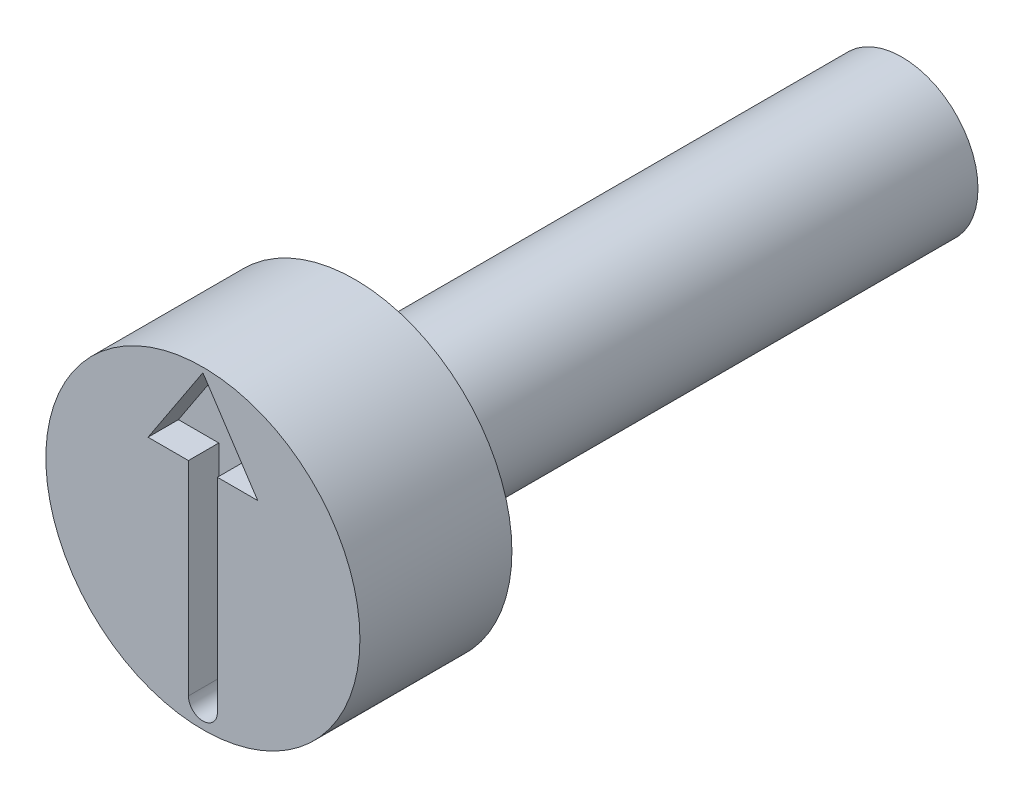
from build123d import *

# Parameters (mm, degrees)
CUT_EXTRUDE4_DEPTH = 0.6


with BuildPart() as part:
    # Sketch2 → Revolve1 (revolve)
    with BuildSketch(Plane(origin=(0, 0, 0), x_dir=(0, 0, -1), z_dir=(1, 0, 0)), mode=Mode.PRIVATE) as revolve1_sk:
        Polygon((0, 3.1), (0, 0), (13.8, 0), (13.8, 1.5), (3, 1.5), (3, 3.1), align=None)
    revolve(revolve1_sk.sketch.rotate(Axis((0, 0, -0.403888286), (0, 0, -1)), 90), axis=Axis((0, 0, -0.403888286), (0, 0, -1)))

    # Sketch3 → Cut-Extrude4 (cut)
    with BuildSketch(Plane.XY):
        with BuildLine():
            Line((0.285709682, 1.359527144), (0.285709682, -2.664242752))
            ThreePointArc((0.285709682, -2.664242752), (0, -2.949952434), (-0.285709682, -2.664242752))
            Line((-0.285709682, -2.664242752), (-0.285709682, 1.359527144))
            Line((-0.285709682, 1.359527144), (-1.082876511, 1.359527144))
            Line((-1.082876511, 1.359527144), (0, 3.00317302))
            Line((0, 3.00317302), (1.082876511, 1.359527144))
            Line((1.082876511, 1.359527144), (0.285709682, 1.359527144))
        make_face()
    extrude(amount=-CUT_EXTRUDE4_DEPTH, mode=Mode.SUBTRACT)


solid = part.part
